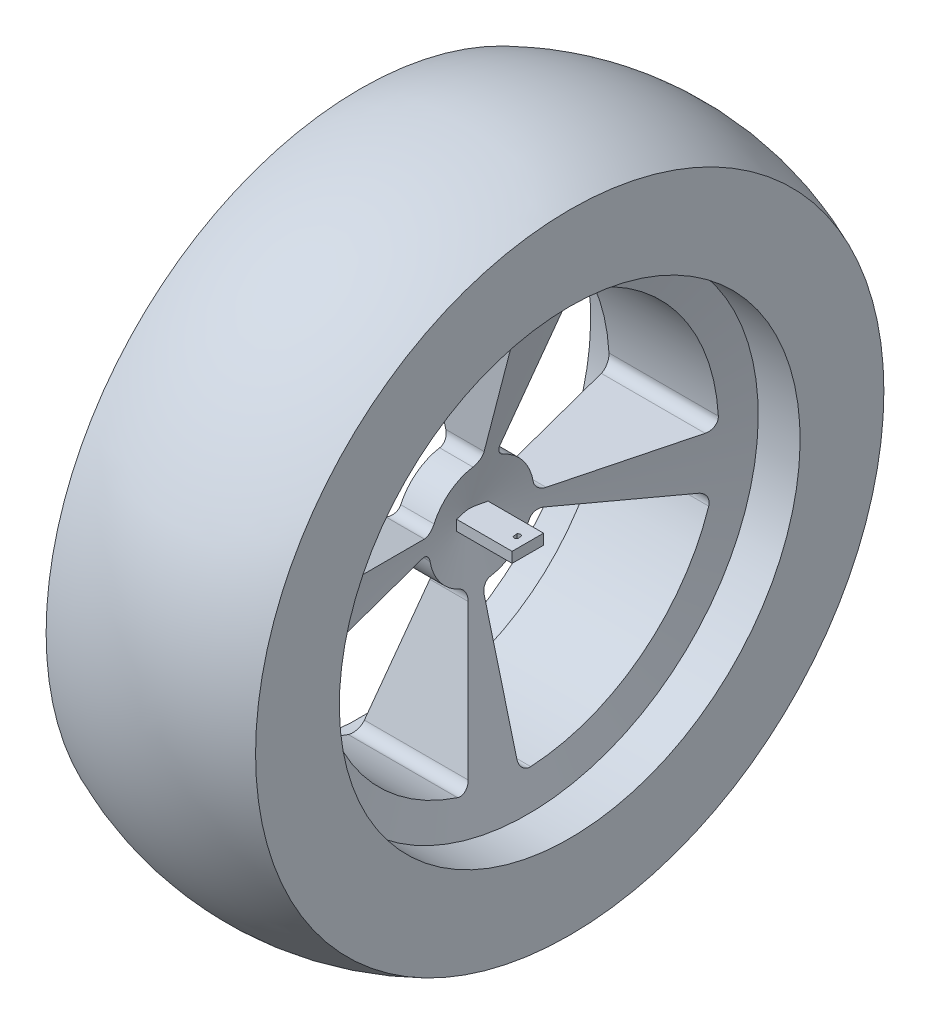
from build123d import *

# Parameters (mm, degrees)
ENL_V_MAT_EXTRU_1_DEPTH      = 465.668348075
ENL_V_MAT_EXTRU_1_DEPTH_BACK = 465.668348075
ESQUISSE3_W                  = 30
ESQUISSE3_H                  = 10
BOSS_EXTRU_1_DEPTH           = 60
ENL_V_MAT_EXTRU_2_REACH      = 470.135


with BuildPart() as part:
    # Esquisse1 → Base-R_volution (revolve)
    with BuildSketch(Plane.XY, mode=Mode.PRIVATE) as base_r_volution_sk:
        with BuildLine():
            Line((-2.923573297, 0), (2.923573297, 0))
            Line((2.923573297, 0), (60, -220))
            Line((60, -220), (100, -220))
            Line((100, -220), (100, -300))
            ThreePointArc((100, -300), (0, -320.871215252), (-100, -300))
            Line((-100, -300), (-100, -220))
            Line((-100, -220), (-60, -220))
            Line((-60, -220), (-2.923573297, 0))
        make_face()
    revolve(base_r_volution_sk.sketch.rotate(Axis((76.658454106, 0, 0), (-1, 0, 0)), 180), axis=Axis((76.658454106, 0, 0), (-1, 0, 0)))

    # Esquisse2 → Enl_v. mat.-Extru.1 (cut, two sides: drawn at the far end of the back side and taken through both)
    with BuildSketch(Plane(origin=(0, 0, 0), x_dir=(0, 0, -1), z_dir=(1, 0, 0)).offset(-ENL_V_MAT_EXTRU_1_DEPTH_BACK)):
        with BuildLine():
            Line((-179.722007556, 0), (-59.160797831, 0))
            ThreePointArc((-59.160797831, 0), (-52.705825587, -2.362373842), (-49.300664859, -8.333333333))
            ThreePointArc((-49.300664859, -8.333333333), (-39.667667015, -30.43807145), (-20.809332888, -45.463960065))
            ThreePointArc((-20.809332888, -45.463960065), (-15.923149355, -50.298490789), (-15.311941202, -57.144942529))
            Line((-15.311941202, -57.144942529), (-46.51547838, -173.598128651))
            ThreePointArc((-46.51547838, -173.598128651), (-51.417323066, -179.805790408), (-59.295555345, -180.510490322))
            ThreePointArc((-59.295555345, -180.510490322), (-150.737134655, -115.664671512), (-189.706563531, -10.555555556))
            ThreePointArc((-189.706563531, -10.555555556), (-186.986839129, -3.128157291), (-179.722007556, 0))
        make_face()
        with BuildLine():
            Line((0, -179.722007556), (0, -59.160797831))
            ThreePointArc((0, -59.160797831), (2.362373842, -52.705825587), (8.333333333, -49.300664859))
            ThreePointArc((8.333333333, -49.300664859), (30.43807145, -39.667667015), (45.463960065, -20.809332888))
            ThreePointArc((45.463960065, -20.809332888), (50.298490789, -15.923149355), (57.144942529, -15.311941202))
            Line((57.144942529, -15.311941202), (173.598128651, -46.51547838))
            ThreePointArc((173.598128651, -46.51547838), (179.805790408, -51.417323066), (180.510490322, -59.295555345))
            ThreePointArc((180.510490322, -59.295555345), (115.664671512, -150.737134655), (10.555555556, -189.706563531))
            ThreePointArc((10.555555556, -189.706563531), (3.128157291, -186.986839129), (0, -179.722007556))
        make_face()
        with BuildLine():
            Line((-173.598128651, 46.51547838), (-57.144942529, 15.311941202))
            ThreePointArc((-57.144942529, 15.311941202), (-50.298490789, 15.923149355), (-45.463960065, 20.809332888))
            ThreePointArc((-45.463960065, 20.809332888), (-30.43807145, 39.667667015), (-8.333333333, 49.300664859))
            ThreePointArc((-8.333333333, 49.300664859), (-2.362373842, 52.705825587), (0, 59.160797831))
            Line((0, 59.160797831), (0, 179.722007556))
            ThreePointArc((0, 179.722007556), (-3.128157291, 186.986839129), (-10.555555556, 189.706563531))
            ThreePointArc((-10.555555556, 189.706563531), (-115.664671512, 150.737134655), (-180.510490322, 59.295555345))
            ThreePointArc((-180.510490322, 59.295555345), (-179.805790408, 51.417323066), (-173.598128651, 46.51547838))
        make_face()
        with BuildLine():
            Line((15.311941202, 57.144942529), (46.51547838, 173.598128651))
            ThreePointArc((46.51547838, 173.598128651), (51.417323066, 179.805790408), (59.295555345, 180.510490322))
            ThreePointArc((59.295555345, 180.510490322), (150.737134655, 115.664671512), (189.706563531, 10.555555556))
            ThreePointArc((189.706563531, 10.555555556), (186.986839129, 3.128157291), (179.722007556, 0))
            Line((179.722007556, 0), (59.160797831, 0))
            ThreePointArc((59.160797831, 0), (52.705825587, 2.362373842), (49.300664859, 8.333333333))
            ThreePointArc((49.300664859, 8.333333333), (39.667667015, 30.43807145), (20.809332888, 45.463960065))
            ThreePointArc((20.809332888, 45.463960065), (15.923149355, 50.298490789), (15.311941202, 57.144942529))
        make_face()
    extrude(amount=ENL_V_MAT_EXTRU_1_DEPTH + ENL_V_MAT_EXTRU_1_DEPTH_BACK, mode=Mode.SUBTRACT)

    # Esquisse3 → Boss.-Extru.1 (add)
    with BuildSketch(Plane(origin=(0, 0, 0), x_dir=(0, 0, -1), z_dir=(1, 0, 0))):
        Rectangle(ESQUISSE3_W, ESQUISSE3_H)
    extrude(amount=BOSS_EXTRU_1_DEPTH)

    # Esquisse4 → Enl_v. mat.-Extru.2 (cut, up to next)
    with BuildSketch(Plane(origin=(0, 5, 0), x_dir=(-1, 0, 0), z_dir=(0, 1, 0)), mode=Mode.PRIVATE) as enl_v_mat_extru_2_sk1:
        with BuildLine():
            Line((-48.319804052, 2.485345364), (-47.716732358, -1.945941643))
            ThreePointArc((-47.716732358, -1.945941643), (-49.595447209, -2.972597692), (-51.680195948, -2.485345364))
            Line((-51.680195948, -2.485345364), (-52.283267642, 1.945941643))
            ThreePointArc((-52.283267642, 1.945941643), (-50.404552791, 2.972597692), (-48.319804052, 2.485345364))
        make_face()
    enl_v_mat_extru_2_tool1 = extrude(enl_v_mat_extru_2_sk1.sketch, amount=-ENL_V_MAT_EXTRU_2_REACH, mode=Mode.PRIVATE) & part.part
    add(enl_v_mat_extru_2_tool1.solids().sort_by_distance((50, 5, 0))[0], mode=Mode.SUBTRACT)


solid = part.part
